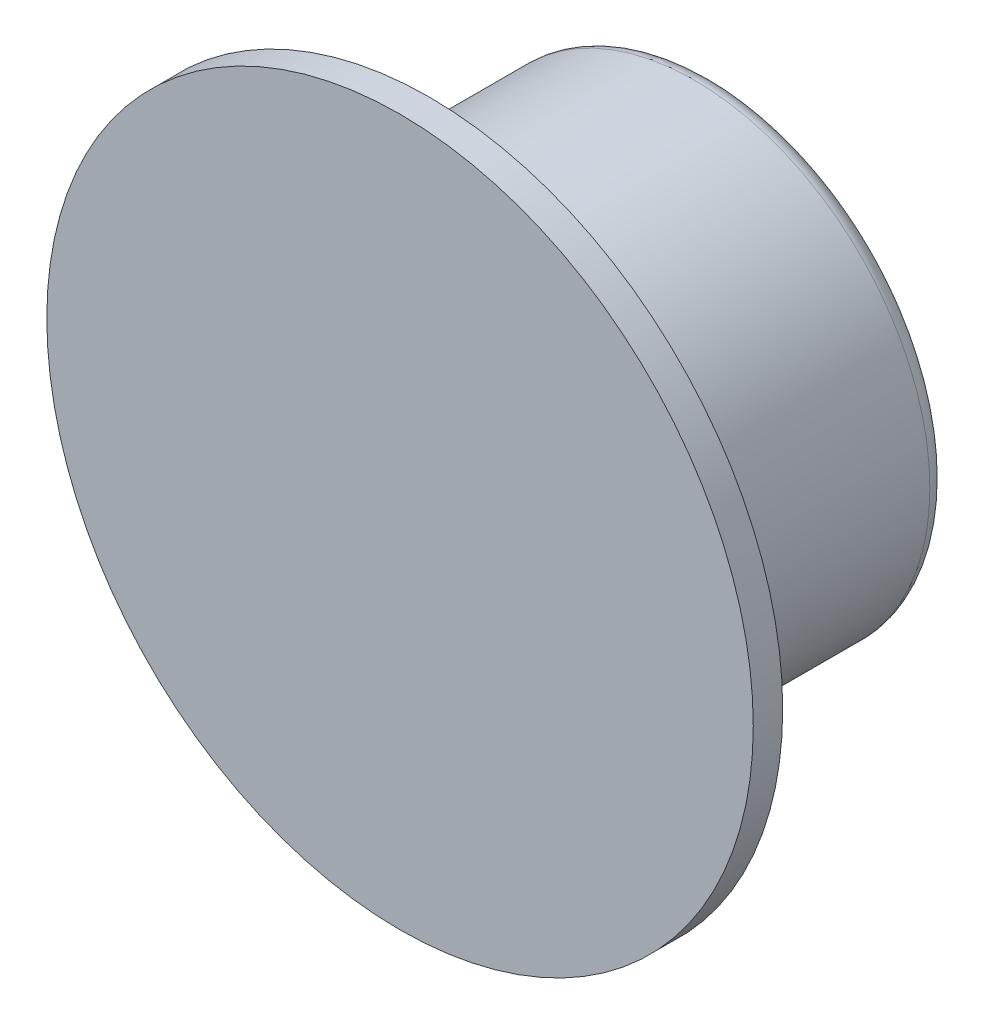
ISO-10303-21;
HEADER;
FILE_DESCRIPTION(('STEP AP214'),'2;1');
FILE_NAME('part.step','',(''),(''),'','','');
FILE_SCHEMA(('AUTOMOTIVE_DESIGN { 1 0 10303 214 1 1 1 1 }'));
ENDSEC;
DATA;
#1=APPLICATION_CONTEXT('core data for automotive mechanical design processes');
#2=APPLICATION_PROTOCOL_DEFINITION('international standard','automotive_design',2000,#1);
#3=PRODUCT_CONTEXT('',#1,'mechanical');
#4=PRODUCT('Part','Part','',(#3));
#5=PRODUCT_RELATED_PRODUCT_CATEGORY('part','',(#4));
#6=PRODUCT_DEFINITION_FORMATION('','',#4);
#7=PRODUCT_DEFINITION_CONTEXT('part definition',#1,'design');
#8=PRODUCT_DEFINITION('design','',#6,#7);
#9=PRODUCT_DEFINITION_SHAPE('','',#8);
#10=(LENGTH_UNIT() NAMED_UNIT(*) SI_UNIT(.MILLI.,.METRE.));
#11=(NAMED_UNIT(*) PLANE_ANGLE_UNIT() SI_UNIT($,.RADIAN.));
#12=(NAMED_UNIT(*) SI_UNIT($,.STERADIAN.) SOLID_ANGLE_UNIT());
#13=UNCERTAINTY_MEASURE_WITH_UNIT(LENGTH_MEASURE(1.E-05),#10,'distance_accuracy_value','');
#14=(GEOMETRIC_REPRESENTATION_CONTEXT(3) GLOBAL_UNCERTAINTY_ASSIGNED_CONTEXT((#13)) GLOBAL_UNIT_ASSIGNED_CONTEXT((#10,
#11,#12)) REPRESENTATION_CONTEXT('',''));
#15=CARTESIAN_POINT('',(0.,0.,0.));
#16=DIRECTION('',(0.,0.,1.));
#17=DIRECTION('',(1.,0.,0.));
#18=AXIS2_PLACEMENT_3D('',#15,#16,#17);
#19=CARTESIAN_POINT('',(0.,0.,0.));
#20=DIRECTION('',(0.,0.,-1.));
#21=DIRECTION('',(-1.,0.,0.));
#22=AXIS2_PLACEMENT_3D('',#19,#20,#21);
#23=PLANE('',#22);
#24=CARTESIAN_POINT('',(0.,0.,0.));
#25=DIRECTION('',(0.,0.,1.));
#26=DIRECTION('',(1.,0.,0.));
#27=AXIS2_PLACEMENT_3D('',#24,#25,#26);
#28=CIRCLE('',#27,60.);
#29=CARTESIAN_POINT('',(60.,0.,0.));
#30=VERTEX_POINT('',#29);
#31=EDGE_CURVE('E11',#30,#30,#28,.T.);
#32=ORIENTED_EDGE('',*,*,#31,.T.);
#33=EDGE_LOOP('',(#32));
#34=FACE_BOUND('',#33,.T.);
#35=ADVANCED_FACE('F32',(#34),#23,.F.);
#36=CARTESIAN_POINT('',(0.,0.,0.));
#37=DIRECTION('',(0.,0.,1.));
#38=DIRECTION('',(1.,0.,0.));
#39=AXIS2_PLACEMENT_3D('',#36,#37,#38);
#40=CYLINDRICAL_SURFACE('',#39,60.);
#41=ORIENTED_EDGE('',*,*,#31,.F.);
#42=EDGE_LOOP('',(#41));
#43=FACE_BOUND('',#42,.T.);
#44=CARTESIAN_POINT('',(0.,0.,-5.));
#45=DIRECTION('',(0.,0.,1.));
#46=DIRECTION('',(1.,0.,0.));
#47=AXIS2_PLACEMENT_3D('',#44,#45,#46);
#48=CIRCLE('',#47,60.);
#49=CARTESIAN_POINT('',(60.,0.,-5.));
#50=VERTEX_POINT('',#49);
#51=EDGE_CURVE('E38',#50,#50,#48,.T.);
#52=ORIENTED_EDGE('',*,*,#51,.T.);
#53=EDGE_LOOP('',(#52));
#54=FACE_BOUND('',#53,.T.);
#55=ADVANCED_FACE('F54',(#43,#54),#40,.T.);
#56=CARTESIAN_POINT('',(0.,60.,-5.));
#57=DIRECTION('',(0.,0.,1.));
#58=DIRECTION('',(1.,0.,0.));
#59=AXIS2_PLACEMENT_3D('',#56,#57,#58);
#60=PLANE('',#59);
#61=ORIENTED_EDGE('',*,*,#51,.F.);
#62=EDGE_LOOP('',(#61));
#63=FACE_BOUND('',#62,.T.);
#64=CARTESIAN_POINT('',(0.,0.,-5.));
#65=DIRECTION('',(0.,0.,1.));
#66=DIRECTION('',(1.,0.,0.));
#67=AXIS2_PLACEMENT_3D('',#64,#65,#66);
#68=CIRCLE('',#67,40.);
#69=CARTESIAN_POINT('',(40.,0.,-5.));
#70=VERTEX_POINT('',#69);
#71=EDGE_CURVE('E66',#70,#70,#68,.T.);
#72=ORIENTED_EDGE('',*,*,#71,.T.);
#73=EDGE_LOOP('',(#72));
#74=FACE_BOUND('',#73,.T.);
#75=ADVANCED_FACE('F59',(#63,#74),#60,.F.);
#76=CARTESIAN_POINT('',(0.,0.,0.));
#77=DIRECTION('',(0.,0.,1.));
#78=DIRECTION('',(1.,0.,0.));
#79=AXIS2_PLACEMENT_3D('',#76,#77,#78);
#80=CYLINDRICAL_SURFACE('',#79,40.);
#81=ORIENTED_EDGE('',*,*,#71,.F.);
#82=EDGE_LOOP('',(#81));
#83=FACE_BOUND('',#82,.T.);
#84=CARTESIAN_POINT('',(0.,0.,-50.));
#85=DIRECTION('',(0.,0.,1.));
#86=DIRECTION('',(1.,0.,0.));
#87=AXIS2_PLACEMENT_3D('',#84,#85,#86);
#88=CIRCLE('',#87,40.);
#89=CARTESIAN_POINT('',(40.,0.,-50.));
#90=VERTEX_POINT('',#89);
#91=EDGE_CURVE('E68',#90,#90,#88,.T.);
#92=ORIENTED_EDGE('',*,*,#91,.T.);
#93=EDGE_LOOP('',(#92));
#94=FACE_BOUND('',#93,.T.);
#95=ADVANCED_FACE('F101',(#83,#94),#80,.T.);
#96=CARTESIAN_POINT('',(0.,0.,-50.));
#97=DIRECTION('',(0.,0.,1.));
#98=DIRECTION('',(1.,0.,0.));
#99=AXIS2_PLACEMENT_3D('',#96,#97,#98);
#100=TOROIDAL_SURFACE('',#99,37.,3.00000000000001);
#101=ORIENTED_EDGE('',*,*,#91,.F.);
#102=EDGE_LOOP('',(#101));
#103=FACE_BOUND('',#102,.T.);
#104=CARTESIAN_POINT('',(0.,0.,-53.));
#105=DIRECTION('',(0.,0.,1.));
#106=DIRECTION('',(1.,0.,0.));
#107=AXIS2_PLACEMENT_3D('',#104,#105,#106);
#108=CIRCLE('',#107,37.);
#109=CARTESIAN_POINT('',(37.,0.,-53.));
#110=VERTEX_POINT('',#109);
#111=EDGE_CURVE('E73',#110,#110,#108,.T.);
#112=ORIENTED_EDGE('',*,*,#111,.T.);
#113=EDGE_LOOP('',(#112));
#114=FACE_BOUND('',#113,.T.);
#115=ADVANCED_FACE('F94',(#103,#114),#100,.T.);
#116=CARTESIAN_POINT('',(0.,37.,-53.));
#117=DIRECTION('',(0.,0.,1.));
#118=DIRECTION('',(1.,0.,0.));
#119=AXIS2_PLACEMENT_3D('',#116,#117,#118);
#120=PLANE('',#119);
#121=ORIENTED_EDGE('',*,*,#111,.F.);
#122=EDGE_LOOP('',(#121));
#123=FACE_BOUND('',#122,.T.);
#124=CARTESIAN_POINT('',(0.,0.,-53.));
#125=DIRECTION('',(0.,0.,1.));
#126=DIRECTION('',(1.,0.,0.));
#127=AXIS2_PLACEMENT_3D('',#124,#125,#126);
#128=CIRCLE('',#127,5.);
#129=CARTESIAN_POINT('',(5.,0.,-53.));
#130=VERTEX_POINT('',#129);
#131=EDGE_CURVE('E76',#130,#130,#128,.T.);
#132=ORIENTED_EDGE('',*,*,#131,.T.);
#133=EDGE_LOOP('',(#132));
#134=FACE_BOUND('',#133,.T.);
#135=ADVANCED_FACE('F88',(#123,#134),#120,.F.);
#136=CARTESIAN_POINT('',(0.,0.,-52.));
#137=DIRECTION('',(0.,0.,-1.));
#138=DIRECTION('',(-1.,0.,0.));
#139=AXIS2_PLACEMENT_3D('',#136,#137,#138);
#140=CONICAL_SURFACE('',#139,4.,0.785398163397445);
#141=ORIENTED_EDGE('',*,*,#131,.F.);
#142=EDGE_LOOP('',(#141));
#143=FACE_BOUND('',#142,.T.);
#144=CARTESIAN_POINT('',(0.,0.,-52.));
#145=DIRECTION('',(0.,0.,1.));
#146=DIRECTION('',(1.,0.,0.));
#147=AXIS2_PLACEMENT_3D('',#144,#145,#146);
#148=CIRCLE('',#147,4.);
#149=CARTESIAN_POINT('',(4.,0.,-52.));
#150=VERTEX_POINT('',#149);
#151=EDGE_CURVE('E79',#150,#150,#148,.T.);
#152=ORIENTED_EDGE('',*,*,#151,.T.);
#153=EDGE_LOOP('',(#152));
#154=FACE_BOUND('',#153,.T.);
#155=ADVANCED_FACE('F49',(#143,#154),#140,.F.);
#156=CARTESIAN_POINT('',(0.,0.,0.));
#157=DIRECTION('',(0.,0.,1.));
#158=DIRECTION('',(1.,0.,0.));
#159=AXIS2_PLACEMENT_3D('',#156,#157,#158);
#160=CYLINDRICAL_SURFACE('',#159,4.);
#161=ORIENTED_EDGE('',*,*,#151,.F.);
#162=EDGE_LOOP('',(#161));
#163=FACE_BOUND('',#162,.T.);
#164=CARTESIAN_POINT('',(0.,0.,-44.));
#165=DIRECTION('',(0.,0.,1.));
#166=DIRECTION('',(1.,0.,0.));
#167=AXIS2_PLACEMENT_3D('',#164,#165,#166);
#168=CIRCLE('',#167,4.);
#169=CARTESIAN_POINT('',(4.,0.,-44.));
#170=VERTEX_POINT('',#169);
#171=EDGE_CURVE('E82',#170,#170,#168,.T.);
#172=ORIENTED_EDGE('',*,*,#171,.T.);
#173=EDGE_LOOP('',(#172));
#174=FACE_BOUND('',#173,.T.);
#175=ADVANCED_FACE('F43',(#163,#174),#160,.F.);
#176=CARTESIAN_POINT('',(0.,0.,-41.6905989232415));
#177=DIRECTION('',(0.,0.,-1.));
#178=DIRECTION('',(-1.,0.,0.));
#179=AXIS2_PLACEMENT_3D('',#176,#177,#178);
#180=CONICAL_SURFACE('',#179,0.,1.0471975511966);
#181=ORIENTED_EDGE('',*,*,#171,.F.);
#182=EDGE_LOOP('',(#181));
#183=FACE_BOUND('',#182,.T.);
#184=CARTESIAN_POINT('',(0.,0.,-41.6905989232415));
#185=VERTEX_POINT('',#184);
#186=VERTEX_LOOP('',#185);
#187=FACE_BOUND('',#186,.T.);
#188=ADVANCED_FACE('F41',(#183,#187),#180,.F.);
#189=CLOSED_SHELL('',(#35,#55,#75,#95,#115,#135,#155,#175,#188));
#190=MANIFOLD_SOLID_BREP('B2',#189);
#191=ADVANCED_BREP_SHAPE_REPRESENTATION('',(#18,#190),#14);
#192=SHAPE_DEFINITION_REPRESENTATION(#9,#191);
ENDSEC;
END-ISO-10303-21;
